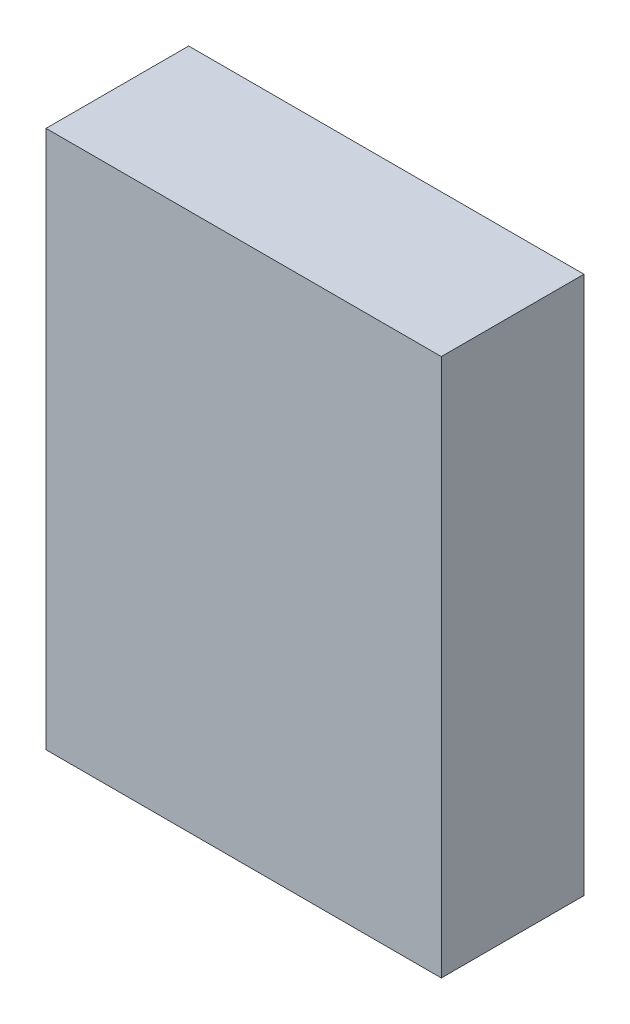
ISO-10303-21;
HEADER;
FILE_DESCRIPTION(('STEP AP214'),'2;1');
FILE_NAME('part.step','',(''),(''),'','','');
FILE_SCHEMA(('AUTOMOTIVE_DESIGN { 1 0 10303 214 1 1 1 1 }'));
ENDSEC;
DATA;
#1=APPLICATION_CONTEXT('core data for automotive mechanical design processes');
#2=APPLICATION_PROTOCOL_DEFINITION('international standard','automotive_design',2000,#1);
#3=PRODUCT_CONTEXT('',#1,'mechanical');
#4=PRODUCT('Part','Part','',(#3));
#5=PRODUCT_RELATED_PRODUCT_CATEGORY('part','',(#4));
#6=PRODUCT_DEFINITION_FORMATION('','',#4);
#7=PRODUCT_DEFINITION_CONTEXT('part definition',#1,'design');
#8=PRODUCT_DEFINITION('design','',#6,#7);
#9=PRODUCT_DEFINITION_SHAPE('','',#8);
#10=(LENGTH_UNIT() NAMED_UNIT(*) SI_UNIT(.MILLI.,.METRE.));
#11=(NAMED_UNIT(*) PLANE_ANGLE_UNIT() SI_UNIT($,.RADIAN.));
#12=(NAMED_UNIT(*) SI_UNIT($,.STERADIAN.) SOLID_ANGLE_UNIT());
#13=UNCERTAINTY_MEASURE_WITH_UNIT(LENGTH_MEASURE(1.E-05),#10,'distance_accuracy_value','');
#14=(GEOMETRIC_REPRESENTATION_CONTEXT(3) GLOBAL_UNCERTAINTY_ASSIGNED_CONTEXT((#13)) GLOBAL_UNIT_ASSIGNED_CONTEXT((#10,
#11,#12)) REPRESENTATION_CONTEXT('',''));
#15=CARTESIAN_POINT('',(0.,0.,0.));
#16=DIRECTION('',(0.,0.,1.));
#17=DIRECTION('',(1.,0.,0.));
#18=AXIS2_PLACEMENT_3D('',#15,#16,#17);
#19=CARTESIAN_POINT('',(-1.5199995,-2.06949802,1.097));
#20=DIRECTION('',(0.,0.,-1.));
#21=DIRECTION('',(-1.,0.,0.));
#22=AXIS2_PLACEMENT_3D('',#19,#20,#21);
#23=PLANE('',#22);
#24=DIRECTION('',(0.,1.,0.));
#25=VECTOR('',#24,1.);
#26=CARTESIAN_POINT('',(1.5199995,-2.06949802,1.097));
#27=LINE('',#26,#25);
#28=CARTESIAN_POINT('',(1.5199995,-2.06949802,1.097));
#29=VERTEX_POINT('',#28);
#30=CARTESIAN_POINT('',(1.5199995,2.06950056,1.097));
#31=VERTEX_POINT('',#30);
#32=EDGE_CURVE('E55',#29,#31,#27,.T.);
#33=ORIENTED_EDGE('',*,*,#32,.T.);
#34=DIRECTION('',(1.,0.,0.));
#35=VECTOR('',#34,1.);
#36=CARTESIAN_POINT('',(1.5199995,2.06950056,1.097));
#37=LINE('',#36,#35);
#38=CARTESIAN_POINT('',(-1.5199995,2.06950056,1.097));
#39=VERTEX_POINT('',#38);
#40=EDGE_CURVE('E57',#31,#39,#37,.F.);
#41=ORIENTED_EDGE('',*,*,#40,.T.);
#42=DIRECTION('',(0.,1.,0.));
#43=VECTOR('',#42,1.);
#44=CARTESIAN_POINT('',(-1.5199995,2.06950056,1.097));
#45=LINE('',#44,#43);
#46=CARTESIAN_POINT('',(-1.5199995,-2.06949802,1.097));
#47=VERTEX_POINT('',#46);
#48=EDGE_CURVE('E20',#39,#47,#45,.F.);
#49=ORIENTED_EDGE('',*,*,#48,.T.);
#50=DIRECTION('',(1.,0.,0.));
#51=VECTOR('',#50,1.);
#52=CARTESIAN_POINT('',(-1.5199995,-2.06949802,1.097));
#53=LINE('',#52,#51);
#54=EDGE_CURVE('E80',#47,#29,#53,.T.);
#55=ORIENTED_EDGE('',*,*,#54,.T.);
#56=EDGE_LOOP('',(#33,#41,#49,#55));
#57=FACE_BOUND('',#56,.T.);
#58=ADVANCED_FACE('F17',(#57),#23,.F.);
#59=CARTESIAN_POINT('',(-1.5199995,2.06950056,0.));
#60=DIRECTION('',(1.,0.,0.));
#61=DIRECTION('',(0.,0.,-1.));
#62=AXIS2_PLACEMENT_3D('',#59,#60,#61);
#63=PLANE('',#62);
#64=DIRECTION('',(0.,0.,1.));
#65=VECTOR('',#64,1.);
#66=CARTESIAN_POINT('',(-1.5199995,-2.06949802,0.));
#67=LINE('',#66,#65);
#68=CARTESIAN_POINT('',(-1.5199995,-2.06949802,0.));
#69=VERTEX_POINT('',#68);
#70=EDGE_CURVE('E68',#69,#47,#67,.T.);
#71=ORIENTED_EDGE('',*,*,#70,.T.);
#72=ORIENTED_EDGE('',*,*,#48,.F.);
#73=DIRECTION('',(0.,0.,-1.));
#74=VECTOR('',#73,1.);
#75=CARTESIAN_POINT('',(-1.5199995,2.06950056,0.));
#76=LINE('',#75,#74);
#77=CARTESIAN_POINT('',(-1.5199995,2.06950056,0.));
#78=VERTEX_POINT('',#77);
#79=EDGE_CURVE('E63',#39,#78,#76,.T.);
#80=ORIENTED_EDGE('',*,*,#79,.T.);
#81=DIRECTION('',(0.,1.,0.));
#82=VECTOR('',#81,1.);
#83=CARTESIAN_POINT('',(-1.5199995,-2.06949802,0.));
#84=LINE('',#83,#82);
#85=EDGE_CURVE('E83',#69,#78,#84,.T.);
#86=ORIENTED_EDGE('',*,*,#85,.F.);
#87=EDGE_LOOP('',(#71,#72,#80,#86));
#88=FACE_BOUND('',#87,.T.);
#89=ADVANCED_FACE('F65',(#88),#63,.F.);
#90=CARTESIAN_POINT('',(1.5199995,2.06950056,0.));
#91=DIRECTION('',(0.,-1.,0.));
#92=DIRECTION('',(0.,0.,-1.));
#93=AXIS2_PLACEMENT_3D('',#90,#91,#92);
#94=PLANE('',#93);
#95=ORIENTED_EDGE('',*,*,#79,.F.);
#96=ORIENTED_EDGE('',*,*,#40,.F.);
#97=DIRECTION('',(0.,0.,1.));
#98=VECTOR('',#97,1.);
#99=CARTESIAN_POINT('',(1.5199995,2.06950056,0.));
#100=LINE('',#99,#98);
#101=CARTESIAN_POINT('',(1.5199995,2.06950056,0.));
#102=VERTEX_POINT('',#101);
#103=EDGE_CURVE('E75',#31,#102,#100,.F.);
#104=ORIENTED_EDGE('',*,*,#103,.T.);
#105=DIRECTION('',(-1.,0.,0.));
#106=VECTOR('',#105,1.);
#107=CARTESIAN_POINT('',(-1.5199995,2.06950056,0.));
#108=LINE('',#107,#106);
#109=EDGE_CURVE('E72',#78,#102,#108,.F.);
#110=ORIENTED_EDGE('',*,*,#109,.F.);
#111=EDGE_LOOP('',(#95,#96,#104,#110));
#112=FACE_BOUND('',#111,.T.);
#113=ADVANCED_FACE('F70',(#112),#94,.F.);
#114=CARTESIAN_POINT('',(1.5199995,-2.06949802,0.));
#115=DIRECTION('',(-1.,0.,0.));
#116=DIRECTION('',(0.,0.,1.));
#117=AXIS2_PLACEMENT_3D('',#114,#115,#116);
#118=PLANE('',#117);
#119=ORIENTED_EDGE('',*,*,#103,.F.);
#120=ORIENTED_EDGE('',*,*,#32,.F.);
#121=DIRECTION('',(0.,0.,1.));
#122=VECTOR('',#121,1.);
#123=CARTESIAN_POINT('',(1.5199995,-2.06949802,0.));
#124=LINE('',#123,#122);
#125=CARTESIAN_POINT('',(1.5199995,-2.06949802,0.));
#126=VERTEX_POINT('',#125);
#127=EDGE_CURVE('E35',#29,#126,#124,.F.);
#128=ORIENTED_EDGE('',*,*,#127,.T.);
#129=DIRECTION('',(0.,1.,0.));
#130=VECTOR('',#129,1.);
#131=CARTESIAN_POINT('',(1.5199995,-2.06949802,0.));
#132=LINE('',#131,#130);
#133=EDGE_CURVE('E26',#102,#126,#132,.F.);
#134=ORIENTED_EDGE('',*,*,#133,.F.);
#135=EDGE_LOOP('',(#119,#120,#128,#134));
#136=FACE_BOUND('',#135,.T.);
#137=ADVANCED_FACE('F89',(#136),#118,.F.);
#138=CARTESIAN_POINT('',(-1.5199995,-2.06949802,0.));
#139=DIRECTION('',(0.,1.,0.));
#140=DIRECTION('',(0.,0.,1.));
#141=AXIS2_PLACEMENT_3D('',#138,#139,#140);
#142=PLANE('',#141);
#143=ORIENTED_EDGE('',*,*,#127,.F.);
#144=ORIENTED_EDGE('',*,*,#54,.F.);
#145=ORIENTED_EDGE('',*,*,#70,.F.);
#146=DIRECTION('',(-1.,0.,0.));
#147=VECTOR('',#146,1.);
#148=CARTESIAN_POINT('',(-1.5199995,-2.06949802,0.));
#149=LINE('',#148,#147);
#150=EDGE_CURVE('E11',#126,#69,#149,.T.);
#151=ORIENTED_EDGE('',*,*,#150,.F.);
#152=EDGE_LOOP('',(#143,#144,#145,#151));
#153=FACE_BOUND('',#152,.T.);
#154=ADVANCED_FACE('F91',(#153),#142,.F.);
#155=CARTESIAN_POINT('',(-1.5199995,-2.06949802,0.));
#156=DIRECTION('',(0.,0.,-1.));
#157=DIRECTION('',(-1.,0.,0.));
#158=AXIS2_PLACEMENT_3D('',#155,#156,#157);
#159=PLANE('',#158);
#160=ORIENTED_EDGE('',*,*,#133,.T.);
#161=ORIENTED_EDGE('',*,*,#150,.T.);
#162=ORIENTED_EDGE('',*,*,#85,.T.);
#163=ORIENTED_EDGE('',*,*,#109,.T.);
#164=EDGE_LOOP('',(#160,#161,#162,#163));
#165=FACE_BOUND('',#164,.T.);
#166=ADVANCED_FACE('F88',(#165),#159,.T.);
#167=CLOSED_SHELL('',(#58,#89,#113,#137,#154,#166));
#168=MANIFOLD_SOLID_BREP('B1',#167);
#169=ADVANCED_BREP_SHAPE_REPRESENTATION('',(#18,#168),#14);
#170=SHAPE_DEFINITION_REPRESENTATION(#9,#169);
ENDSEC;
END-ISO-10303-21;
